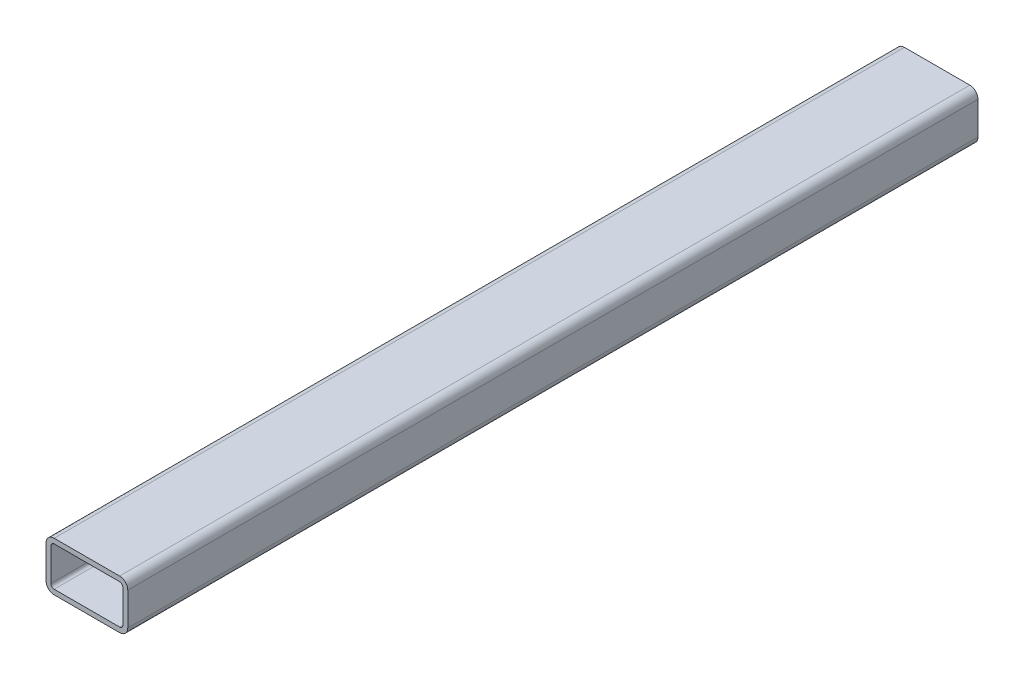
from build123d import *

# Parameters (mm, degrees)
BOSS_EXTRU_1_DEPTH = 130


with BuildPart() as part:
    # Esquisse1 → Boss.-Extru.1 (new, symmetric)
    with BuildSketch(Plane.XY):
        with BuildLine():
            Line((-10, 7.5), (10, 7.5))
            ThreePointArc((10, 7.5), (11.767766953, 6.767766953), (12.5, 5))
            Line((12.5, 5), (12.5, -5))
            ThreePointArc((12.5, -5), (11.767766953, -6.767766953), (10, -7.5))
            Line((10, -7.5), (-10, -7.5))
            ThreePointArc((-10, -7.5), (-11.767766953, -6.767766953), (-12.5, -5))
            Line((-12.5, -5), (-12.5, 5))
            ThreePointArc((-12.5, 5), (-11.767766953, 6.767766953), (-10, 7.5))
        make_face()
        with BuildLine():
            Line((-10, 6), (10, 6))
            ThreePointArc((10, 6), (10.707106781, 5.707106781), (11, 5))
            Line((11, 5), (11, -5))
            ThreePointArc((11, -5), (10.707106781, -5.707106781), (10, -6))
            Line((10, -6), (-10, -6))
            ThreePointArc((-10, -6), (-10.707106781, -5.707106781), (-11, -5))
            Line((-11, -5), (-11, 5))
            ThreePointArc((-11, 5), (-10.707106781, 5.707106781), (-10, 6))
        make_face(mode=Mode.SUBTRACT)
    extrude(amount=BOSS_EXTRU_1_DEPTH, both=True)


solid = part.part
